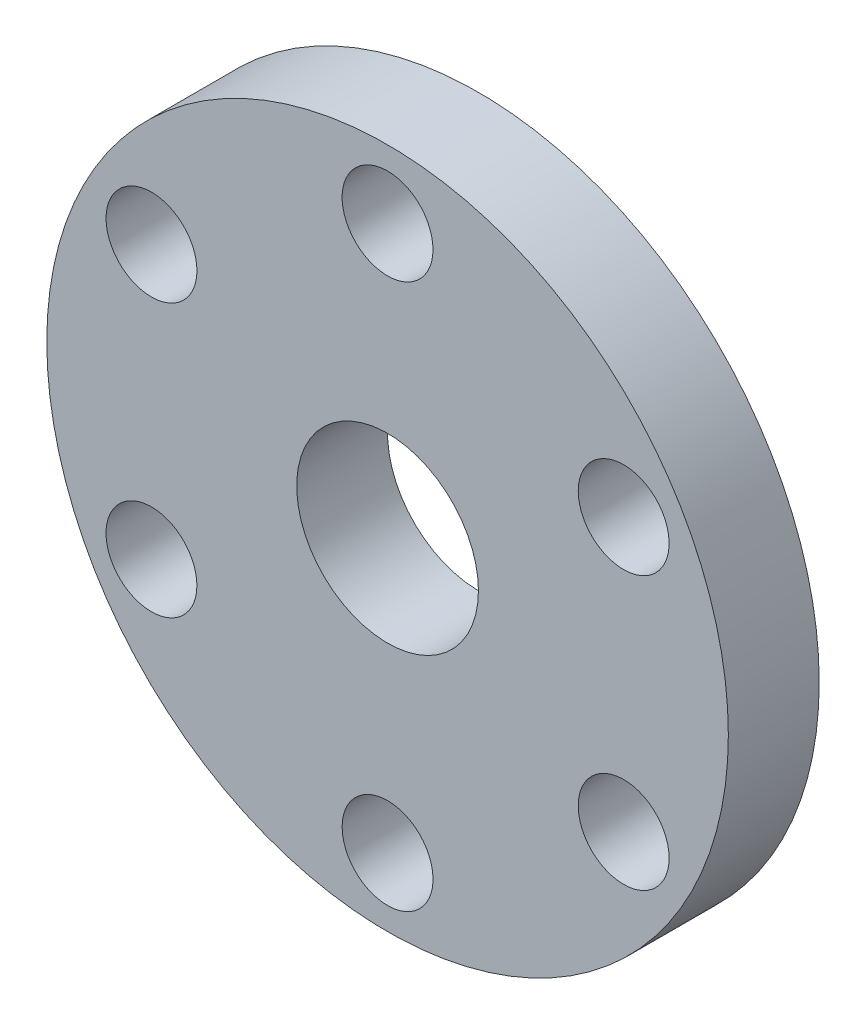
from build123d import *

# Parameters (mm, degrees)
SZKIC1_R                    = 75
SZKIC1_R_2                  = 20
DODANIE_WYCI_GNI_CIE1_DEPTH = 20
SZKIC2_R                    = 10
WYTNIJ_WYCI_GNI_CIE1_DEPTH  = 108.935165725
SZYK_KO_OWY1_COUNT          = 6


with BuildPart() as part:
    # Szkic1 → Dodanie-wyci_gni_cie1 (new body)
    with BuildSketch(Plane.XY):
        Circle(SZKIC1_R)
        Circle(SZKIC1_R_2, mode=Mode.SUBTRACT)
    extrude(amount=DODANIE_WYCI_GNI_CIE1_DEPTH)

    # Szkic2 → Wytnij-wyci_gni_cie1 (cut, through all)
    with BuildSketch(Plane.XY.offset(20)):
        with Locations((0, 60)):
            Circle(SZKIC2_R)
    wytnij_wyci_gni_cie1 = extrude(amount=-WYTNIJ_WYCI_GNI_CIE1_DEPTH, mode=Mode.SUBTRACT)

    # Szyk ko_owy1: Wytnij-wyci_gni_cie1 ×6 about axis
    szyk_ko_owy1_axis = Axis((0, 0, 0), (0, 0, 1))
    for i in range(1, SZYK_KO_OWY1_COUNT):
        add(wytnij_wyci_gni_cie1.rotate(szyk_ko_owy1_axis, i * 360 / SZYK_KO_OWY1_COUNT), mode=Mode.SUBTRACT)


solid = part.part
